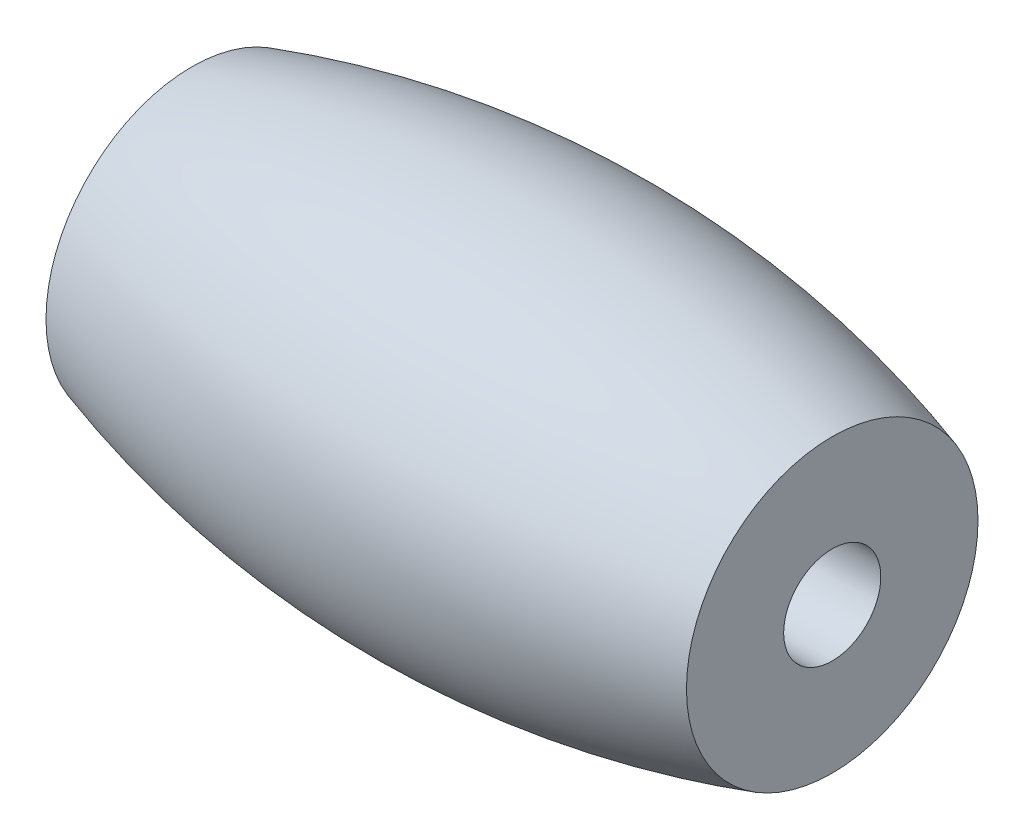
from build123d import *

# Parameters (mm, degrees)
SKETCH2_R          = 1.1
CUT_EXTRUDE1_DEPTH = 16.778783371


with BuildPart() as part:
    # Sketch1 → Revolve1 (revolve)
    with BuildSketch(Plane(origin=(0, 0, 0), x_dir=(1, 0, 0), z_dir=(0, 1, 0))):
        with BuildLine():
            Line((-7.25, 0), (7.25, 0))
            Line((7.25, 0), (7.25, -3.3))
            ThreePointArc((7.25, -3.3), (0, -4.4), (-7.25, -3.3))
            Line((-7.25, -3.3), (-7.25, 0))
        make_face()
    revolve(axis=Axis((-7.25, 0, 0), (1, 0, 0)))

    # Sketch2 → Cut-Extrude1 (cut, through all)
    with BuildSketch(Plane.ZY.offset(7.25)):
        Circle(SKETCH2_R)
    extrude(amount=-CUT_EXTRUDE1_DEPTH, mode=Mode.SUBTRACT)


solid = part.part
